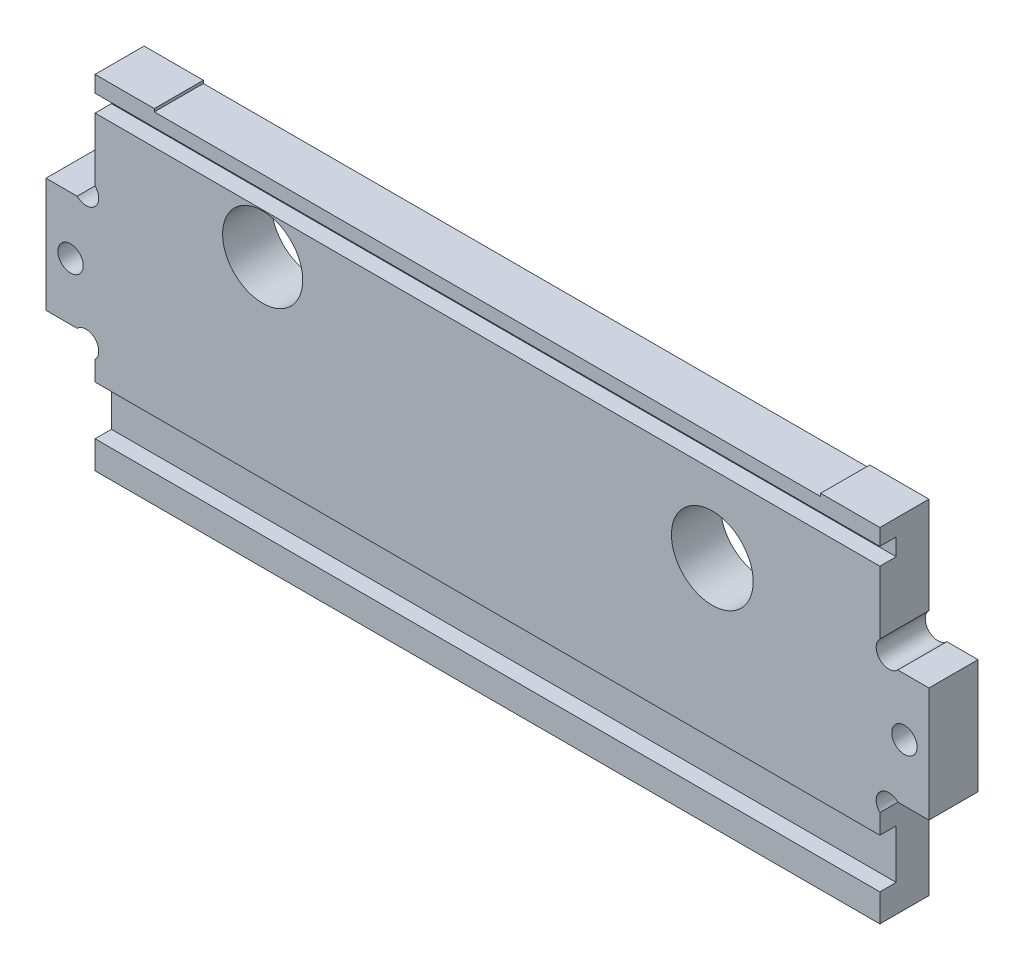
ISO-10303-21;
HEADER;
FILE_DESCRIPTION(('STEP AP214'),'2;1');
FILE_NAME('part.step','',(''),(''),'','','');
FILE_SCHEMA(('AUTOMOTIVE_DESIGN { 1 0 10303 214 1 1 1 1 }'));
ENDSEC;
DATA;
#1=APPLICATION_CONTEXT('core data for automotive mechanical design processes');
#2=APPLICATION_PROTOCOL_DEFINITION('international standard','automotive_design',2000,#1);
#3=PRODUCT_CONTEXT('',#1,'mechanical');
#4=PRODUCT('Part','Part','',(#3));
#5=PRODUCT_RELATED_PRODUCT_CATEGORY('part','',(#4));
#6=PRODUCT_DEFINITION_FORMATION('','',#4);
#7=PRODUCT_DEFINITION_CONTEXT('part definition',#1,'design');
#8=PRODUCT_DEFINITION('design','',#6,#7);
#9=PRODUCT_DEFINITION_SHAPE('','',#8);
#10=(LENGTH_UNIT() NAMED_UNIT(*) SI_UNIT(.MILLI.,.METRE.));
#11=(NAMED_UNIT(*) PLANE_ANGLE_UNIT() SI_UNIT($,.RADIAN.));
#12=(NAMED_UNIT(*) SI_UNIT($,.STERADIAN.) SOLID_ANGLE_UNIT());
#13=UNCERTAINTY_MEASURE_WITH_UNIT(LENGTH_MEASURE(1.E-05),#10,'distance_accuracy_value','');
#14=(GEOMETRIC_REPRESENTATION_CONTEXT(3) GLOBAL_UNCERTAINTY_ASSIGNED_CONTEXT((#13)) GLOBAL_UNIT_ASSIGNED_CONTEXT((#10,
#11,#12)) REPRESENTATION_CONTEXT('',''));
#15=CARTESIAN_POINT('',(0.,0.,0.));
#16=DIRECTION('',(0.,0.,1.));
#17=DIRECTION('',(1.,0.,0.));
#18=AXIS2_PLACEMENT_3D('',#15,#16,#17);
#19=CARTESIAN_POINT('',(4.90398448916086,29.0960155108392,6.));
#20=DIRECTION('',(0.,0.,1.));
#21=DIRECTION('',(1.,0.,0.));
#22=AXIS2_PLACEMENT_3D('',#19,#20,#21);
#23=PLANE('',#22);
#24=DIRECTION('',(-1.,0.,0.));
#25=VECTOR('',#24,1.);
#26=CARTESIAN_POINT('',(4.34837507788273,9.39999999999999,6.));
#27=LINE('',#26,#25);
#28=CARTESIAN_POINT('',(102.,9.39999999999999,6.));
#29=VERTEX_POINT('',#28);
#30=CARTESIAN_POINT('',(6.,9.39999999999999,6.));
#31=VERTEX_POINT('',#30);
#32=EDGE_CURVE('E232',#29,#31,#27,.T.);
#33=ORIENTED_EDGE('',*,*,#32,.F.);
#34=DIRECTION('',(0.,1.,0.));
#35=VECTOR('',#34,1.);
#36=CARTESIAN_POINT('',(102.,11.8079689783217,6.));
#37=LINE('',#36,#35);
#38=CARTESIAN_POINT('',(102.,11.8079689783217,6.));
#39=VERTEX_POINT('',#38);
#40=EDGE_CURVE('E248',#29,#39,#37,.T.);
#41=ORIENTED_EDGE('',*,*,#40,.T.);
#42=CARTESIAN_POINT('',(103.096015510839,12.9039844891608,6.));
#43=DIRECTION('',(0.,0.,-1.));
#44=DIRECTION('',(1.,0.,0.));
#45=AXIS2_PLACEMENT_3D('',#42,#43,#44);
#46=CIRCLE('',#45,1.55);
#47=CARTESIAN_POINT('',(104.192031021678,14.,6.));
#48=VERTEX_POINT('',#47);
#49=EDGE_CURVE('E250',#39,#48,#46,.T.);
#50=ORIENTED_EDGE('',*,*,#49,.T.);
#51=DIRECTION('',(1.,0.,0.));
#52=VECTOR('',#51,1.);
#53=CARTESIAN_POINT('',(108.,14.,6.));
#54=LINE('',#53,#52);
#55=CARTESIAN_POINT('',(108.,14.,6.));
#56=VERTEX_POINT('',#55);
#57=EDGE_CURVE('E252',#48,#56,#54,.T.);
#58=ORIENTED_EDGE('',*,*,#57,.T.);
#59=DIRECTION('',(0.,1.,0.));
#60=VECTOR('',#59,1.);
#61=CARTESIAN_POINT('',(108.,28.,6.));
#62=LINE('',#61,#60);
#63=CARTESIAN_POINT('',(108.,28.,6.));
#64=VERTEX_POINT('',#63);
#65=EDGE_CURVE('E254',#56,#64,#62,.T.);
#66=ORIENTED_EDGE('',*,*,#65,.T.);
#67=DIRECTION('',(-1.,0.,0.));
#68=VECTOR('',#67,1.);
#69=CARTESIAN_POINT('',(104.192031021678,28.,6.));
#70=LINE('',#69,#68);
#71=CARTESIAN_POINT('',(104.192031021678,28.,6.));
#72=VERTEX_POINT('',#71);
#73=EDGE_CURVE('E256',#64,#72,#70,.T.);
#74=ORIENTED_EDGE('',*,*,#73,.T.);
#75=CARTESIAN_POINT('',(103.096015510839,29.0960155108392,6.));
#76=DIRECTION('',(0.,0.,-1.));
#77=DIRECTION('',(-1.,0.,0.));
#78=AXIS2_PLACEMENT_3D('',#75,#76,#77);
#79=CIRCLE('',#78,1.55);
#80=CARTESIAN_POINT('',(102.,30.1920310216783,6.));
#81=VERTEX_POINT('',#80);
#82=EDGE_CURVE('E258',#72,#81,#79,.T.);
#83=ORIENTED_EDGE('',*,*,#82,.T.);
#84=DIRECTION('',(0.,1.,0.));
#85=VECTOR('',#84,1.);
#86=CARTESIAN_POINT('',(102.,42.,6.));
#87=LINE('',#86,#85);
#88=CARTESIAN_POINT('',(102.,37.9,6.));
#89=VERTEX_POINT('',#88);
#90=EDGE_CURVE('E261',#81,#89,#87,.T.);
#91=ORIENTED_EDGE('',*,*,#90,.T.);
#92=DIRECTION('',(1.,0.,0.));
#93=VECTOR('',#92,1.);
#94=CARTESIAN_POINT('',(4.34837507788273,37.9,6.));
#95=LINE('',#94,#93);
#96=CARTESIAN_POINT('',(6.00000000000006,37.9,6.));
#97=VERTEX_POINT('',#96);
#98=EDGE_CURVE('E359',#97,#89,#95,.T.);
#99=ORIENTED_EDGE('',*,*,#98,.F.);
#100=DIRECTION('',(0.,-1.,0.));
#101=VECTOR('',#100,1.);
#102=CARTESIAN_POINT('',(6.00000000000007,42.,6.));
#103=LINE('',#102,#101);
#104=CARTESIAN_POINT('',(6.,30.1920310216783,6.));
#105=VERTEX_POINT('',#104);
#106=EDGE_CURVE('E440',#97,#105,#103,.T.);
#107=ORIENTED_EDGE('',*,*,#106,.T.);
#108=CARTESIAN_POINT('',(4.90398448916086,29.0960155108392,6.));
#109=DIRECTION('',(0.,0.,-1.));
#110=DIRECTION('',(1.,0.,0.));
#111=AXIS2_PLACEMENT_3D('',#108,#109,#110);
#112=CIRCLE('',#111,1.55);
#113=CARTESIAN_POINT('',(3.80796897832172,28.,6.));
#114=VERTEX_POINT('',#113);
#115=EDGE_CURVE('E444',#105,#114,#112,.T.);
#116=ORIENTED_EDGE('',*,*,#115,.T.);
#117=DIRECTION('',(-1.,0.,0.));
#118=VECTOR('',#117,1.);
#119=CARTESIAN_POINT('',(3.80796897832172,28.,6.));
#120=LINE('',#119,#118);
#121=CARTESIAN_POINT('',(0.,28.,6.));
#122=VERTEX_POINT('',#121);
#123=EDGE_CURVE('E446',#114,#122,#120,.T.);
#124=ORIENTED_EDGE('',*,*,#123,.T.);
#125=DIRECTION('',(0.,-1.,0.));
#126=VECTOR('',#125,1.);
#127=CARTESIAN_POINT('',(0.,28.,6.));
#128=LINE('',#127,#126);
#129=CARTESIAN_POINT('',(0.,14.,6.));
#130=VERTEX_POINT('',#129);
#131=EDGE_CURVE('E448',#122,#130,#128,.T.);
#132=ORIENTED_EDGE('',*,*,#131,.T.);
#133=DIRECTION('',(1.,0.,0.));
#134=VECTOR('',#133,1.);
#135=CARTESIAN_POINT('',(0.,14.,6.));
#136=LINE('',#135,#134);
#137=CARTESIAN_POINT('',(3.80796897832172,14.,6.));
#138=VERTEX_POINT('',#137);
#139=EDGE_CURVE('E243',#130,#138,#136,.T.);
#140=ORIENTED_EDGE('',*,*,#139,.T.);
#141=CARTESIAN_POINT('',(4.90398448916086,12.9039844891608,6.));
#142=DIRECTION('',(0.,0.,-1.));
#143=DIRECTION('',(-1.,0.,0.));
#144=AXIS2_PLACEMENT_3D('',#141,#142,#143);
#145=CIRCLE('',#144,1.55);
#146=CARTESIAN_POINT('',(6.,11.8079689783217,6.));
#147=VERTEX_POINT('',#146);
#148=EDGE_CURVE('E239',#138,#147,#145,.T.);
#149=ORIENTED_EDGE('',*,*,#148,.T.);
#150=DIRECTION('',(0.,-1.,0.));
#151=VECTOR('',#150,1.);
#152=CARTESIAN_POINT('',(6.,11.8079689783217,6.));
#153=LINE('',#152,#151);
#154=EDGE_CURVE('E238',#147,#31,#153,.T.);
#155=ORIENTED_EDGE('',*,*,#154,.T.);
#156=EDGE_LOOP('',(#33,#41,#50,#58,#66,#74,#83,#91,#99,#107,#116,#124,#132,#140,#149,#155));
#157=FACE_BOUND('',#156,.T.);
#158=CARTESIAN_POINT('',(26.5,32.9,6.));
#159=DIRECTION('',(0.,0.,1.));
#160=DIRECTION('',(1.,0.,0.));
#161=AXIS2_PLACEMENT_3D('',#158,#159,#160);
#162=CIRCLE('',#161,4.9);
#163=CARTESIAN_POINT('',(31.4,32.9,6.));
#164=VERTEX_POINT('',#163);
#165=EDGE_CURVE('E378',#164,#164,#162,.T.);
#166=ORIENTED_EDGE('',*,*,#165,.F.);
#167=EDGE_LOOP('',(#166));
#168=FACE_BOUND('',#167,.T.);
#169=CARTESIAN_POINT('',(3.,21.,6.));
#170=DIRECTION('',(0.,0.,1.));
#171=DIRECTION('',(1.,0.,0.));
#172=AXIS2_PLACEMENT_3D('',#169,#170,#171);
#173=CIRCLE('',#172,1.55);
#174=CARTESIAN_POINT('',(4.55,21.,6.));
#175=VERTEX_POINT('',#174);
#176=EDGE_CURVE('E390',#175,#175,#173,.T.);
#177=ORIENTED_EDGE('',*,*,#176,.F.);
#178=EDGE_LOOP('',(#177));
#179=FACE_BOUND('',#178,.T.);
#180=CARTESIAN_POINT('',(81.5,28.5,6.));
#181=DIRECTION('',(0.,0.,1.));
#182=DIRECTION('',(1.,0.,0.));
#183=AXIS2_PLACEMENT_3D('',#180,#181,#182);
#184=CIRCLE('',#183,5.);
#185=CARTESIAN_POINT('',(86.5,28.5,6.));
#186=VERTEX_POINT('',#185);
#187=EDGE_CURVE('E396',#186,#186,#184,.T.);
#188=ORIENTED_EDGE('',*,*,#187,.F.);
#189=EDGE_LOOP('',(#188));
#190=FACE_BOUND('',#189,.T.);
#191=CARTESIAN_POINT('',(105.,21.,6.));
#192=DIRECTION('',(0.,0.,1.));
#193=DIRECTION('',(-1.,0.,0.));
#194=AXIS2_PLACEMENT_3D('',#191,#192,#193);
#195=CIRCLE('',#194,1.55000000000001);
#196=CARTESIAN_POINT('',(103.45,21.,6.));
#197=VERTEX_POINT('',#196);
#198=EDGE_CURVE('E384',#197,#197,#195,.T.);
#199=ORIENTED_EDGE('',*,*,#198,.F.);
#200=EDGE_LOOP('',(#199));
#201=FACE_BOUND('',#200,.T.);
#202=ADVANCED_FACE('F30',(#157,#168,#179,#190,#201),#23,.T.);
#203=DIRECTION('',(-1.,0.,0.));
#204=VECTOR('',#203,1.);
#205=CARTESIAN_POINT('',(4.34837507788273,40.,6.));
#206=LINE('',#205,#204);
#207=CARTESIAN_POINT('',(102.,40.,6.));
#208=VERTEX_POINT('',#207);
#209=CARTESIAN_POINT('',(6.00000000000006,40.,6.));
#210=VERTEX_POINT('',#209);
#211=EDGE_CURVE('E361',#208,#210,#206,.T.);
#212=ORIENTED_EDGE('',*,*,#211,.F.);
#213=CARTESIAN_POINT('',(102.,42.,6.));
#214=VERTEX_POINT('',#213);
#215=EDGE_CURVE('E260',#208,#214,#87,.T.);
#216=ORIENTED_EDGE('',*,*,#215,.T.);
#217=DIRECTION('',(-1.,0.,0.));
#218=VECTOR('',#217,1.);
#219=CARTESIAN_POINT('',(94.75,42.,6.));
#220=LINE('',#219,#218);
#221=CARTESIAN_POINT('',(94.75,42.,6.));
#222=VERTEX_POINT('',#221);
#223=EDGE_CURVE('E264',#214,#222,#220,.T.);
#224=ORIENTED_EDGE('',*,*,#223,.T.);
#225=DIRECTION('',(0.,-1.,0.));
#226=VECTOR('',#225,1.);
#227=CARTESIAN_POINT('',(94.75,42.,6.));
#228=LINE('',#227,#226);
#229=CARTESIAN_POINT('',(94.75,41.65,6.));
#230=VERTEX_POINT('',#229);
#231=EDGE_CURVE('E266',#222,#230,#228,.T.);
#232=ORIENTED_EDGE('',*,*,#231,.T.);
#233=DIRECTION('',(-1.,0.,0.));
#234=VECTOR('',#233,1.);
#235=CARTESIAN_POINT('',(13.25,41.65,6.));
#236=LINE('',#235,#234);
#237=CARTESIAN_POINT('',(13.25,41.65,6.));
#238=VERTEX_POINT('',#237);
#239=EDGE_CURVE('E268',#230,#238,#236,.T.);
#240=ORIENTED_EDGE('',*,*,#239,.T.);
#241=DIRECTION('',(0.,1.,0.));
#242=VECTOR('',#241,1.);
#243=CARTESIAN_POINT('',(13.25,42.,6.));
#244=LINE('',#243,#242);
#245=CARTESIAN_POINT('',(13.25,42.,6.));
#246=VERTEX_POINT('',#245);
#247=EDGE_CURVE('E270',#238,#246,#244,.T.);
#248=ORIENTED_EDGE('',*,*,#247,.T.);
#249=DIRECTION('',(-1.,0.,0.));
#250=VECTOR('',#249,1.);
#251=CARTESIAN_POINT('',(6.00000000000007,42.,6.));
#252=LINE('',#251,#250);
#253=CARTESIAN_POINT('',(6.00000000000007,42.,6.));
#254=VERTEX_POINT('',#253);
#255=EDGE_CURVE('E272',#246,#254,#252,.T.);
#256=ORIENTED_EDGE('',*,*,#255,.T.);
#257=EDGE_CURVE('E441',#254,#210,#103,.T.);
#258=ORIENTED_EDGE('',*,*,#257,.T.);
#259=EDGE_LOOP('',(#212,#216,#224,#232,#240,#248,#256,#258));
#260=FACE_BOUND('',#259,.T.);
#261=ADVANCED_FACE('F535',(#260),#23,.T.);
#262=DIRECTION('',(1.,0.,0.));
#263=VECTOR('',#262,1.);
#264=CARTESIAN_POINT('',(4.34837507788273,3.40000000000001,6.));
#265=LINE('',#264,#263);
#266=CARTESIAN_POINT('',(6.,3.40000000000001,6.));
#267=VERTEX_POINT('',#266);
#268=CARTESIAN_POINT('',(102.,3.40000000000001,6.));
#269=VERTEX_POINT('',#268);
#270=EDGE_CURVE('E217',#267,#269,#265,.T.);
#271=ORIENTED_EDGE('',*,*,#270,.F.);
#272=CARTESIAN_POINT('',(6.,0.,6.));
#273=VERTEX_POINT('',#272);
#274=EDGE_CURVE('E228',#267,#273,#153,.T.);
#275=ORIENTED_EDGE('',*,*,#274,.T.);
#276=DIRECTION('',(1.,0.,0.));
#277=VECTOR('',#276,1.);
#278=CARTESIAN_POINT('',(6.,0.,6.));
#279=LINE('',#278,#277);
#280=CARTESIAN_POINT('',(102.,0.,6.));
#281=VERTEX_POINT('',#280);
#282=EDGE_CURVE('E242',#273,#281,#279,.T.);
#283=ORIENTED_EDGE('',*,*,#282,.T.);
#284=EDGE_CURVE('E231',#281,#269,#37,.T.);
#285=ORIENTED_EDGE('',*,*,#284,.T.);
#286=EDGE_LOOP('',(#271,#275,#283,#285));
#287=FACE_BOUND('',#286,.T.);
#288=ADVANCED_FACE('F227',(#287),#23,.T.);
#289=CARTESIAN_POINT('',(4.90398448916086,29.0960155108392,0.));
#290=DIRECTION('',(0.,0.,1.));
#291=DIRECTION('',(1.,0.,0.));
#292=AXIS2_PLACEMENT_3D('',#289,#290,#291);
#293=PLANE('',#292);
#294=CARTESIAN_POINT('',(105.,21.,0.));
#295=DIRECTION('',(0.,0.,1.));
#296=DIRECTION('',(-1.,0.,0.));
#297=AXIS2_PLACEMENT_3D('',#294,#295,#296);
#298=CIRCLE('',#297,1.55000000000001);
#299=CARTESIAN_POINT('',(103.45,21.,0.));
#300=VERTEX_POINT('',#299);
#301=EDGE_CURVE('E381',#300,#300,#298,.T.);
#302=ORIENTED_EDGE('',*,*,#301,.T.);
#303=EDGE_LOOP('',(#302));
#304=FACE_BOUND('',#303,.T.);
#305=CARTESIAN_POINT('',(81.5,28.5,0.));
#306=DIRECTION('',(0.,0.,1.));
#307=DIRECTION('',(1.,0.,0.));
#308=AXIS2_PLACEMENT_3D('',#305,#306,#307);
#309=CIRCLE('',#308,5.);
#310=CARTESIAN_POINT('',(86.5,28.5,0.));
#311=VERTEX_POINT('',#310);
#312=EDGE_CURVE('E393',#311,#311,#309,.T.);
#313=ORIENTED_EDGE('',*,*,#312,.T.);
#314=EDGE_LOOP('',(#313));
#315=FACE_BOUND('',#314,.T.);
#316=DIRECTION('',(0.,-1.,0.));
#317=VECTOR('',#316,1.);
#318=CARTESIAN_POINT('',(6.00000000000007,42.,0.));
#319=LINE('',#318,#317);
#320=CARTESIAN_POINT('',(6.00000000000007,42.,0.));
#321=VERTEX_POINT('',#320);
#322=CARTESIAN_POINT('',(6.,30.1920310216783,0.));
#323=VERTEX_POINT('',#322);
#324=EDGE_CURVE('E399',#321,#323,#319,.T.);
#325=ORIENTED_EDGE('',*,*,#324,.F.);
#326=DIRECTION('',(-1.,0.,0.));
#327=VECTOR('',#326,1.);
#328=CARTESIAN_POINT('',(6.00000000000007,42.,0.));
#329=LINE('',#328,#327);
#330=CARTESIAN_POINT('',(13.25,42.,0.));
#331=VERTEX_POINT('',#330);
#332=EDGE_CURVE('E438',#331,#321,#329,.T.);
#333=ORIENTED_EDGE('',*,*,#332,.F.);
#334=DIRECTION('',(0.,1.,0.));
#335=VECTOR('',#334,1.);
#336=CARTESIAN_POINT('',(13.25,42.,0.));
#337=LINE('',#336,#335);
#338=CARTESIAN_POINT('',(13.25,41.65,0.));
#339=VERTEX_POINT('',#338);
#340=EDGE_CURVE('E436',#339,#331,#337,.T.);
#341=ORIENTED_EDGE('',*,*,#340,.F.);
#342=DIRECTION('',(-1.,0.,0.));
#343=VECTOR('',#342,1.);
#344=CARTESIAN_POINT('',(13.25,41.65,0.));
#345=LINE('',#344,#343);
#346=CARTESIAN_POINT('',(94.75,41.65,0.));
#347=VERTEX_POINT('',#346);
#348=EDGE_CURVE('E434',#347,#339,#345,.T.);
#349=ORIENTED_EDGE('',*,*,#348,.F.);
#350=DIRECTION('',(0.,-1.,0.));
#351=VECTOR('',#350,1.);
#352=CARTESIAN_POINT('',(94.75,42.,0.));
#353=LINE('',#352,#351);
#354=CARTESIAN_POINT('',(94.75,42.,0.));
#355=VERTEX_POINT('',#354);
#356=EDGE_CURVE('E432',#355,#347,#353,.T.);
#357=ORIENTED_EDGE('',*,*,#356,.F.);
#358=DIRECTION('',(-1.,0.,0.));
#359=VECTOR('',#358,1.);
#360=CARTESIAN_POINT('',(94.75,42.,0.));
#361=LINE('',#360,#359);
#362=CARTESIAN_POINT('',(102.,42.,0.));
#363=VERTEX_POINT('',#362);
#364=EDGE_CURVE('E430',#363,#355,#361,.T.);
#365=ORIENTED_EDGE('',*,*,#364,.F.);
#366=DIRECTION('',(0.,1.,0.));
#367=VECTOR('',#366,1.);
#368=CARTESIAN_POINT('',(102.,42.,0.));
#369=LINE('',#368,#367);
#370=CARTESIAN_POINT('',(102.,30.1920310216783,0.));
#371=VERTEX_POINT('',#370);
#372=EDGE_CURVE('E428',#371,#363,#369,.T.);
#373=ORIENTED_EDGE('',*,*,#372,.F.);
#374=CARTESIAN_POINT('',(103.096015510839,29.0960155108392,0.));
#375=DIRECTION('',(0.,0.,-1.));
#376=DIRECTION('',(-1.,0.,0.));
#377=AXIS2_PLACEMENT_3D('',#374,#375,#376);
#378=CIRCLE('',#377,1.55);
#379=CARTESIAN_POINT('',(104.192031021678,28.,0.));
#380=VERTEX_POINT('',#379);
#381=EDGE_CURVE('E426',#380,#371,#378,.T.);
#382=ORIENTED_EDGE('',*,*,#381,.F.);
#383=DIRECTION('',(-1.,0.,0.));
#384=VECTOR('',#383,1.);
#385=CARTESIAN_POINT('',(104.192031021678,28.,0.));
#386=LINE('',#385,#384);
#387=CARTESIAN_POINT('',(108.,28.,0.));
#388=VERTEX_POINT('',#387);
#389=EDGE_CURVE('E424',#388,#380,#386,.T.);
#390=ORIENTED_EDGE('',*,*,#389,.F.);
#391=DIRECTION('',(0.,1.,0.));
#392=VECTOR('',#391,1.);
#393=CARTESIAN_POINT('',(108.,28.,0.));
#394=LINE('',#393,#392);
#395=CARTESIAN_POINT('',(108.,14.,0.));
#396=VERTEX_POINT('',#395);
#397=EDGE_CURVE('E422',#396,#388,#394,.T.);
#398=ORIENTED_EDGE('',*,*,#397,.F.);
#399=DIRECTION('',(1.,0.,0.));
#400=VECTOR('',#399,1.);
#401=CARTESIAN_POINT('',(108.,14.,0.));
#402=LINE('',#401,#400);
#403=CARTESIAN_POINT('',(104.192031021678,14.,0.));
#404=VERTEX_POINT('',#403);
#405=EDGE_CURVE('E420',#404,#396,#402,.T.);
#406=ORIENTED_EDGE('',*,*,#405,.F.);
#407=CARTESIAN_POINT('',(103.096015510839,12.9039844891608,0.));
#408=DIRECTION('',(0.,0.,-1.));
#409=DIRECTION('',(1.,0.,0.));
#410=AXIS2_PLACEMENT_3D('',#407,#408,#409);
#411=CIRCLE('',#410,1.55);
#412=CARTESIAN_POINT('',(102.,11.8079689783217,0.));
#413=VERTEX_POINT('',#412);
#414=EDGE_CURVE('E418',#413,#404,#411,.T.);
#415=ORIENTED_EDGE('',*,*,#414,.F.);
#416=DIRECTION('',(0.,1.,0.));
#417=VECTOR('',#416,1.);
#418=CARTESIAN_POINT('',(102.,11.8079689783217,0.));
#419=LINE('',#418,#417);
#420=CARTESIAN_POINT('',(102.,0.,0.));
#421=VERTEX_POINT('',#420);
#422=EDGE_CURVE('E416',#421,#413,#419,.T.);
#423=ORIENTED_EDGE('',*,*,#422,.F.);
#424=DIRECTION('',(1.,0.,0.));
#425=VECTOR('',#424,1.);
#426=CARTESIAN_POINT('',(6.,0.,0.));
#427=LINE('',#426,#425);
#428=CARTESIAN_POINT('',(6.,0.,0.));
#429=VERTEX_POINT('',#428);
#430=EDGE_CURVE('E414',#429,#421,#427,.T.);
#431=ORIENTED_EDGE('',*,*,#430,.F.);
#432=DIRECTION('',(0.,-1.,0.));
#433=VECTOR('',#432,1.);
#434=CARTESIAN_POINT('',(6.,11.8079689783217,0.));
#435=LINE('',#434,#433);
#436=CARTESIAN_POINT('',(6.,11.8079689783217,0.));
#437=VERTEX_POINT('',#436);
#438=EDGE_CURVE('E412',#437,#429,#435,.T.);
#439=ORIENTED_EDGE('',*,*,#438,.F.);
#440=CARTESIAN_POINT('',(4.90398448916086,12.9039844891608,0.));
#441=DIRECTION('',(0.,0.,-1.));
#442=DIRECTION('',(-1.,0.,0.));
#443=AXIS2_PLACEMENT_3D('',#440,#441,#442);
#444=CIRCLE('',#443,1.55);
#445=CARTESIAN_POINT('',(3.80796897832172,14.,0.));
#446=VERTEX_POINT('',#445);
#447=EDGE_CURVE('E410',#446,#437,#444,.T.);
#448=ORIENTED_EDGE('',*,*,#447,.F.);
#449=DIRECTION('',(1.,0.,0.));
#450=VECTOR('',#449,1.);
#451=CARTESIAN_POINT('',(0.,14.,0.));
#452=LINE('',#451,#450);
#453=CARTESIAN_POINT('',(0.,14.,0.));
#454=VERTEX_POINT('',#453);
#455=EDGE_CURVE('E408',#454,#446,#452,.T.);
#456=ORIENTED_EDGE('',*,*,#455,.F.);
#457=DIRECTION('',(0.,-1.,0.));
#458=VECTOR('',#457,1.);
#459=CARTESIAN_POINT('',(0.,28.,0.));
#460=LINE('',#459,#458);
#461=CARTESIAN_POINT('',(0.,28.,0.));
#462=VERTEX_POINT('',#461);
#463=EDGE_CURVE('E406',#462,#454,#460,.T.);
#464=ORIENTED_EDGE('',*,*,#463,.F.);
#465=DIRECTION('',(-1.,0.,0.));
#466=VECTOR('',#465,1.);
#467=CARTESIAN_POINT('',(3.80796897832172,28.,0.));
#468=LINE('',#467,#466);
#469=CARTESIAN_POINT('',(3.80796897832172,28.,0.));
#470=VERTEX_POINT('',#469);
#471=EDGE_CURVE('E404',#470,#462,#468,.T.);
#472=ORIENTED_EDGE('',*,*,#471,.F.);
#473=CARTESIAN_POINT('',(4.90398448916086,29.0960155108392,0.));
#474=DIRECTION('',(0.,0.,-1.));
#475=DIRECTION('',(1.,0.,0.));
#476=AXIS2_PLACEMENT_3D('',#473,#474,#475);
#477=CIRCLE('',#476,1.55);
#478=EDGE_CURVE('E402',#323,#470,#477,.T.);
#479=ORIENTED_EDGE('',*,*,#478,.F.);
#480=EDGE_LOOP('',(#325,#333,#341,#349,#357,#365,#373,#382,#390,#398,#406,#415,#423,#431,#439,
#448,#456,#464,#472,#479));
#481=FACE_BOUND('',#480,.T.);
#482=CARTESIAN_POINT('',(3.,21.,0.));
#483=DIRECTION('',(0.,0.,1.));
#484=DIRECTION('',(1.,0.,0.));
#485=AXIS2_PLACEMENT_3D('',#482,#483,#484);
#486=CIRCLE('',#485,1.55);
#487=CARTESIAN_POINT('',(4.55,21.,0.));
#488=VERTEX_POINT('',#487);
#489=EDGE_CURVE('E387',#488,#488,#486,.T.);
#490=ORIENTED_EDGE('',*,*,#489,.T.);
#491=EDGE_LOOP('',(#490));
#492=FACE_BOUND('',#491,.T.);
#493=CARTESIAN_POINT('',(26.5,32.9,0.));
#494=DIRECTION('',(0.,0.,1.));
#495=DIRECTION('',(1.,0.,0.));
#496=AXIS2_PLACEMENT_3D('',#493,#494,#495);
#497=CIRCLE('',#496,4.9);
#498=CARTESIAN_POINT('',(31.4,32.9,0.));
#499=VERTEX_POINT('',#498);
#500=EDGE_CURVE('E375',#499,#499,#497,.T.);
#501=ORIENTED_EDGE('',*,*,#500,.T.);
#502=EDGE_LOOP('',(#501));
#503=FACE_BOUND('',#502,.T.);
#504=ADVANCED_FACE('F519',(#304,#315,#481,#492,#503),#293,.F.);
#505=CARTESIAN_POINT('',(6.00000000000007,42.,6.));
#506=DIRECTION('',(1.,0.,0.));
#507=DIRECTION('',(0.,1.,0.));
#508=AXIS2_PLACEMENT_3D('',#505,#506,#507);
#509=PLANE('',#508);
#510=DIRECTION('',(0.,-1.,0.));
#511=VECTOR('',#510,1.);
#512=CARTESIAN_POINT('',(6.00000000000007,42.,4.));
#513=LINE('',#512,#511);
#514=CARTESIAN_POINT('',(6.00000000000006,40.,4.));
#515=VERTEX_POINT('',#514);
#516=CARTESIAN_POINT('',(6.00000000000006,37.9,4.));
#517=VERTEX_POINT('',#516);
#518=EDGE_CURVE('E367',#515,#517,#513,.T.);
#519=ORIENTED_EDGE('',*,*,#518,.F.);
#520=DIRECTION('',(0.,0.,1.));
#521=VECTOR('',#520,1.);
#522=CARTESIAN_POINT('',(6.00000000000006,40.,6.));
#523=LINE('',#522,#521);
#524=EDGE_CURVE('E372',#515,#210,#523,.T.);
#525=ORIENTED_EDGE('',*,*,#524,.T.);
#526=ORIENTED_EDGE('',*,*,#257,.F.);
#527=DIRECTION('',(0.,0.,-1.));
#528=VECTOR('',#527,1.);
#529=CARTESIAN_POINT('',(6.00000000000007,42.,6.));
#530=LINE('',#529,#528);
#531=EDGE_CURVE('E274',#254,#321,#530,.T.);
#532=ORIENTED_EDGE('',*,*,#531,.T.);
#533=ORIENTED_EDGE('',*,*,#324,.T.);
#534=DIRECTION('',(0.,0.,-1.));
#535=VECTOR('',#534,1.);
#536=CARTESIAN_POINT('',(6.,30.1920310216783,6.));
#537=LINE('',#536,#535);
#538=EDGE_CURVE('E329',#105,#323,#537,.T.);
#539=ORIENTED_EDGE('',*,*,#538,.F.);
#540=ORIENTED_EDGE('',*,*,#106,.F.);
#541=DIRECTION('',(0.,0.,-1.));
#542=VECTOR('',#541,1.);
#543=CARTESIAN_POINT('',(6.00000000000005,37.9,6.));
#544=LINE('',#543,#542);
#545=EDGE_CURVE('E369',#97,#517,#544,.T.);
#546=ORIENTED_EDGE('',*,*,#545,.T.);
#547=EDGE_LOOP('',(#519,#525,#526,#532,#533,#539,#540,#546));
#548=FACE_BOUND('',#547,.T.);
#549=ADVANCED_FACE('F32',(#548),#509,.F.);
#550=CARTESIAN_POINT('',(4.90398448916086,29.0960155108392,6.));
#551=DIRECTION('',(0.,0.,-1.));
#552=DIRECTION('',(-1.,0.,0.));
#553=AXIS2_PLACEMENT_3D('',#550,#551,#552);
#554=CYLINDRICAL_SURFACE('',#553,1.55);
#555=ORIENTED_EDGE('',*,*,#478,.T.);
#556=DIRECTION('',(0.,0.,-1.));
#557=VECTOR('',#556,1.);
#558=CARTESIAN_POINT('',(3.80796897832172,28.,6.));
#559=LINE('',#558,#557);
#560=EDGE_CURVE('E326',#114,#470,#559,.T.);
#561=ORIENTED_EDGE('',*,*,#560,.F.);
#562=ORIENTED_EDGE('',*,*,#115,.F.);
#563=ORIENTED_EDGE('',*,*,#538,.T.);
#564=EDGE_LOOP('',(#555,#561,#562,#563));
#565=FACE_BOUND('',#564,.T.);
#566=ADVANCED_FACE('F508',(#565),#554,.F.);
#567=CARTESIAN_POINT('',(3.80796897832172,28.,6.));
#568=DIRECTION('',(0.,-1.,0.));
#569=DIRECTION('',(0.,0.,-1.));
#570=AXIS2_PLACEMENT_3D('',#567,#568,#569);
#571=PLANE('',#570);
#572=ORIENTED_EDGE('',*,*,#471,.T.);
#573=DIRECTION('',(0.,0.,-1.));
#574=VECTOR('',#573,1.);
#575=CARTESIAN_POINT('',(0.,28.,6.));
#576=LINE('',#575,#574);
#577=EDGE_CURVE('E323',#122,#462,#576,.T.);
#578=ORIENTED_EDGE('',*,*,#577,.F.);
#579=ORIENTED_EDGE('',*,*,#123,.F.);
#580=ORIENTED_EDGE('',*,*,#560,.T.);
#581=EDGE_LOOP('',(#572,#578,#579,#580));
#582=FACE_BOUND('',#581,.T.);
#583=ADVANCED_FACE('F513',(#582),#571,.F.);
#584=CARTESIAN_POINT('',(0.,28.,6.));
#585=DIRECTION('',(1.,0.,0.));
#586=DIRECTION('',(0.,0.,-1.));
#587=AXIS2_PLACEMENT_3D('',#584,#585,#586);
#588=PLANE('',#587);
#589=ORIENTED_EDGE('',*,*,#463,.T.);
#590=DIRECTION('',(0.,0.,-1.));
#591=VECTOR('',#590,1.);
#592=CARTESIAN_POINT('',(0.,14.,6.));
#593=LINE('',#592,#591);
#594=EDGE_CURVE('E320',#130,#454,#593,.T.);
#595=ORIENTED_EDGE('',*,*,#594,.F.);
#596=ORIENTED_EDGE('',*,*,#131,.F.);
#597=ORIENTED_EDGE('',*,*,#577,.T.);
#598=EDGE_LOOP('',(#589,#595,#596,#597));
#599=FACE_BOUND('',#598,.T.);
#600=ADVANCED_FACE('F517',(#599),#588,.F.);
#601=CARTESIAN_POINT('',(0.,14.,6.));
#602=DIRECTION('',(0.,1.,0.));
#603=DIRECTION('',(0.,0.,1.));
#604=AXIS2_PLACEMENT_3D('',#601,#602,#603);
#605=PLANE('',#604);
#606=ORIENTED_EDGE('',*,*,#455,.T.);
#607=DIRECTION('',(0.,0.,-1.));
#608=VECTOR('',#607,1.);
#609=CARTESIAN_POINT('',(3.80796897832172,14.,6.));
#610=LINE('',#609,#608);
#611=EDGE_CURVE('E317',#138,#446,#610,.T.);
#612=ORIENTED_EDGE('',*,*,#611,.F.);
#613=ORIENTED_EDGE('',*,*,#139,.F.);
#614=ORIENTED_EDGE('',*,*,#594,.T.);
#615=EDGE_LOOP('',(#606,#612,#613,#614));
#616=FACE_BOUND('',#615,.T.);
#617=ADVANCED_FACE('F458',(#616),#605,.F.);
#618=CARTESIAN_POINT('',(4.90398448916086,12.9039844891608,6.));
#619=DIRECTION('',(0.,0.,-1.));
#620=DIRECTION('',(-1.,0.,0.));
#621=AXIS2_PLACEMENT_3D('',#618,#619,#620);
#622=CYLINDRICAL_SURFACE('',#621,1.55);
#623=ORIENTED_EDGE('',*,*,#447,.T.);
#624=DIRECTION('',(0.,0.,-1.));
#625=VECTOR('',#624,1.);
#626=CARTESIAN_POINT('',(6.,11.8079689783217,6.));
#627=LINE('',#626,#625);
#628=EDGE_CURVE('E314',#147,#437,#627,.T.);
#629=ORIENTED_EDGE('',*,*,#628,.F.);
#630=ORIENTED_EDGE('',*,*,#148,.F.);
#631=ORIENTED_EDGE('',*,*,#611,.T.);
#632=EDGE_LOOP('',(#623,#629,#630,#631));
#633=FACE_BOUND('',#632,.T.);
#634=ADVANCED_FACE('F462',(#633),#622,.F.);
#635=CARTESIAN_POINT('',(6.,11.8079689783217,6.));
#636=DIRECTION('',(1.,0.,0.));
#637=DIRECTION('',(0.,1.,0.));
#638=AXIS2_PLACEMENT_3D('',#635,#636,#637);
#639=PLANE('',#638);
#640=DIRECTION('',(0.,-1.,0.));
#641=VECTOR('',#640,1.);
#642=CARTESIAN_POINT('',(6.,11.8079689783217,4.));
#643=LINE('',#642,#641);
#644=CARTESIAN_POINT('',(6.,9.39999999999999,4.));
#645=VERTEX_POINT('',#644);
#646=CARTESIAN_POINT('',(6.,3.40000000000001,4.));
#647=VERTEX_POINT('',#646);
#648=EDGE_CURVE('E223',#645,#647,#643,.T.);
#649=ORIENTED_EDGE('',*,*,#648,.F.);
#650=DIRECTION('',(0.,0.,1.));
#651=VECTOR('',#650,1.);
#652=CARTESIAN_POINT('',(6.,9.39999999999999,6.));
#653=LINE('',#652,#651);
#654=EDGE_CURVE('E222',#645,#31,#653,.T.);
#655=ORIENTED_EDGE('',*,*,#654,.T.);
#656=ORIENTED_EDGE('',*,*,#154,.F.);
#657=ORIENTED_EDGE('',*,*,#628,.T.);
#658=ORIENTED_EDGE('',*,*,#438,.T.);
#659=DIRECTION('',(0.,0.,-1.));
#660=VECTOR('',#659,1.);
#661=CARTESIAN_POINT('',(6.,0.,6.));
#662=LINE('',#661,#660);
#663=EDGE_CURVE('E236',#273,#429,#662,.T.);
#664=ORIENTED_EDGE('',*,*,#663,.F.);
#665=ORIENTED_EDGE('',*,*,#274,.F.);
#666=DIRECTION('',(0.,0.,-1.));
#667=VECTOR('',#666,1.);
#668=CARTESIAN_POINT('',(6.,3.40000000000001,6.));
#669=LINE('',#668,#667);
#670=EDGE_CURVE('E214',#267,#647,#669,.T.);
#671=ORIENTED_EDGE('',*,*,#670,.T.);
#672=EDGE_LOOP('',(#649,#655,#656,#657,#658,#664,#665,#671));
#673=FACE_BOUND('',#672,.T.);
#674=ADVANCED_FACE('F234',(#673),#639,.F.);
#675=CARTESIAN_POINT('',(6.,0.,6.));
#676=DIRECTION('',(0.,1.,0.));
#677=DIRECTION('',(-1.,0.,0.));
#678=AXIS2_PLACEMENT_3D('',#675,#676,#677);
#679=PLANE('',#678);
#680=ORIENTED_EDGE('',*,*,#430,.T.);
#681=DIRECTION('',(0.,0.,-1.));
#682=VECTOR('',#681,1.);
#683=CARTESIAN_POINT('',(102.,0.,6.));
#684=LINE('',#683,#682);
#685=EDGE_CURVE('E310',#281,#421,#684,.T.);
#686=ORIENTED_EDGE('',*,*,#685,.F.);
#687=ORIENTED_EDGE('',*,*,#282,.F.);
#688=ORIENTED_EDGE('',*,*,#663,.T.);
#689=EDGE_LOOP('',(#680,#686,#687,#688));
#690=FACE_BOUND('',#689,.T.);
#691=ADVANCED_FACE('F523',(#690),#679,.F.);
#692=CARTESIAN_POINT('',(102.,11.8079689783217,6.));
#693=DIRECTION('',(-1.,0.,0.));
#694=DIRECTION('',(0.,-1.,0.));
#695=AXIS2_PLACEMENT_3D('',#692,#693,#694);
#696=PLANE('',#695);
#697=ORIENTED_EDGE('',*,*,#40,.F.);
#698=DIRECTION('',(0.,0.,-1.));
#699=VECTOR('',#698,1.);
#700=CARTESIAN_POINT('',(102.,9.39999999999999,6.));
#701=LINE('',#700,#699);
#702=CARTESIAN_POINT('',(102.,9.39999999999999,4.));
#703=VERTEX_POINT('',#702);
#704=EDGE_CURVE('E11',#29,#703,#701,.T.);
#705=ORIENTED_EDGE('',*,*,#704,.T.);
#706=DIRECTION('',(0.,1.,0.));
#707=VECTOR('',#706,1.);
#708=CARTESIAN_POINT('',(102.,11.8079689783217,4.));
#709=LINE('',#708,#707);
#710=CARTESIAN_POINT('',(102.,3.40000000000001,4.));
#711=VERTEX_POINT('',#710);
#712=EDGE_CURVE('E340',#711,#703,#709,.T.);
#713=ORIENTED_EDGE('',*,*,#712,.F.);
#714=DIRECTION('',(0.,0.,1.));
#715=VECTOR('',#714,1.);
#716=CARTESIAN_POINT('',(102.,3.40000000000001,6.));
#717=LINE('',#716,#715);
#718=EDGE_CURVE('E38',#711,#269,#717,.T.);
#719=ORIENTED_EDGE('',*,*,#718,.T.);
#720=ORIENTED_EDGE('',*,*,#284,.F.);
#721=ORIENTED_EDGE('',*,*,#685,.T.);
#722=ORIENTED_EDGE('',*,*,#422,.T.);
#723=DIRECTION('',(0.,0.,-1.));
#724=VECTOR('',#723,1.);
#725=CARTESIAN_POINT('',(102.,11.8079689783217,6.));
#726=LINE('',#725,#724);
#727=EDGE_CURVE('E307',#39,#413,#726,.T.);
#728=ORIENTED_EDGE('',*,*,#727,.F.);
#729=EDGE_LOOP('',(#697,#705,#713,#719,#720,#721,#722,#728));
#730=FACE_BOUND('',#729,.T.);
#731=ADVANCED_FACE('F344',(#730),#696,.F.);
#732=CARTESIAN_POINT('',(103.096015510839,12.9039844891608,6.));
#733=DIRECTION('',(0.,0.,-1.));
#734=DIRECTION('',(-1.,0.,0.));
#735=AXIS2_PLACEMENT_3D('',#732,#733,#734);
#736=CYLINDRICAL_SURFACE('',#735,1.55);
#737=ORIENTED_EDGE('',*,*,#414,.T.);
#738=DIRECTION('',(0.,0.,-1.));
#739=VECTOR('',#738,1.);
#740=CARTESIAN_POINT('',(104.192031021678,14.,6.));
#741=LINE('',#740,#739);
#742=EDGE_CURVE('E304',#48,#404,#741,.T.);
#743=ORIENTED_EDGE('',*,*,#742,.F.);
#744=ORIENTED_EDGE('',*,*,#49,.F.);
#745=ORIENTED_EDGE('',*,*,#727,.T.);
#746=EDGE_LOOP('',(#737,#743,#744,#745));
#747=FACE_BOUND('',#746,.T.);
#748=ADVANCED_FACE('F471',(#747),#736,.F.);
#749=CARTESIAN_POINT('',(108.,14.,6.));
#750=DIRECTION('',(0.,1.,0.));
#751=DIRECTION('',(0.,0.,1.));
#752=AXIS2_PLACEMENT_3D('',#749,#750,#751);
#753=PLANE('',#752);
#754=ORIENTED_EDGE('',*,*,#405,.T.);
#755=DIRECTION('',(0.,0.,-1.));
#756=VECTOR('',#755,1.);
#757=CARTESIAN_POINT('',(108.,14.,6.));
#758=LINE('',#757,#756);
#759=EDGE_CURVE('E301',#56,#396,#758,.T.);
#760=ORIENTED_EDGE('',*,*,#759,.F.);
#761=ORIENTED_EDGE('',*,*,#57,.F.);
#762=ORIENTED_EDGE('',*,*,#742,.T.);
#763=EDGE_LOOP('',(#754,#760,#761,#762));
#764=FACE_BOUND('',#763,.T.);
#765=ADVANCED_FACE('F477',(#764),#753,.F.);
#766=CARTESIAN_POINT('',(108.,28.,6.));
#767=DIRECTION('',(-1.,0.,0.));
#768=DIRECTION('',(0.,0.,1.));
#769=AXIS2_PLACEMENT_3D('',#766,#767,#768);
#770=PLANE('',#769);
#771=ORIENTED_EDGE('',*,*,#397,.T.);
#772=DIRECTION('',(0.,0.,-1.));
#773=VECTOR('',#772,1.);
#774=CARTESIAN_POINT('',(108.,28.,6.));
#775=LINE('',#774,#773);
#776=EDGE_CURVE('E298',#64,#388,#775,.T.);
#777=ORIENTED_EDGE('',*,*,#776,.F.);
#778=ORIENTED_EDGE('',*,*,#65,.F.);
#779=ORIENTED_EDGE('',*,*,#759,.T.);
#780=EDGE_LOOP('',(#771,#777,#778,#779));
#781=FACE_BOUND('',#780,.T.);
#782=ADVANCED_FACE('F481',(#781),#770,.F.);
#783=CARTESIAN_POINT('',(104.192031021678,28.,6.));
#784=DIRECTION('',(0.,-1.,0.));
#785=DIRECTION('',(0.,0.,-1.));
#786=AXIS2_PLACEMENT_3D('',#783,#784,#785);
#787=PLANE('',#786);
#788=ORIENTED_EDGE('',*,*,#389,.T.);
#789=DIRECTION('',(0.,0.,-1.));
#790=VECTOR('',#789,1.);
#791=CARTESIAN_POINT('',(104.192031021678,28.,6.));
#792=LINE('',#791,#790);
#793=EDGE_CURVE('E295',#72,#380,#792,.T.);
#794=ORIENTED_EDGE('',*,*,#793,.F.);
#795=ORIENTED_EDGE('',*,*,#73,.F.);
#796=ORIENTED_EDGE('',*,*,#776,.T.);
#797=EDGE_LOOP('',(#788,#794,#795,#796));
#798=FACE_BOUND('',#797,.T.);
#799=ADVANCED_FACE('F486',(#798),#787,.F.);
#800=CARTESIAN_POINT('',(103.096015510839,29.0960155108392,6.));
#801=DIRECTION('',(0.,0.,-1.));
#802=DIRECTION('',(-1.,0.,0.));
#803=AXIS2_PLACEMENT_3D('',#800,#801,#802);
#804=CYLINDRICAL_SURFACE('',#803,1.55);
#805=ORIENTED_EDGE('',*,*,#381,.T.);
#806=DIRECTION('',(0.,0.,-1.));
#807=VECTOR('',#806,1.);
#808=CARTESIAN_POINT('',(102.,30.1920310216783,6.));
#809=LINE('',#808,#807);
#810=EDGE_CURVE('E292',#81,#371,#809,.T.);
#811=ORIENTED_EDGE('',*,*,#810,.F.);
#812=ORIENTED_EDGE('',*,*,#82,.F.);
#813=ORIENTED_EDGE('',*,*,#793,.T.);
#814=EDGE_LOOP('',(#805,#811,#812,#813));
#815=FACE_BOUND('',#814,.T.);
#816=ADVANCED_FACE('F492',(#815),#804,.F.);
#817=CARTESIAN_POINT('',(102.,42.,6.));
#818=DIRECTION('',(-1.,0.,0.));
#819=DIRECTION('',(0.,-1.,0.));
#820=AXIS2_PLACEMENT_3D('',#817,#818,#819);
#821=PLANE('',#820);
#822=ORIENTED_EDGE('',*,*,#215,.F.);
#823=DIRECTION('',(0.,0.,-1.));
#824=VECTOR('',#823,1.);
#825=CARTESIAN_POINT('',(102.,40.,6.));
#826=LINE('',#825,#824);
#827=CARTESIAN_POINT('',(102.,40.,4.));
#828=VERTEX_POINT('',#827);
#829=EDGE_CURVE('E337',#208,#828,#826,.T.);
#830=ORIENTED_EDGE('',*,*,#829,.T.);
#831=DIRECTION('',(0.,1.,0.));
#832=VECTOR('',#831,1.);
#833=CARTESIAN_POINT('',(102.,42.,4.));
#834=LINE('',#833,#832);
#835=CARTESIAN_POINT('',(102.,37.9,4.));
#836=VERTEX_POINT('',#835);
#837=EDGE_CURVE('E332',#836,#828,#834,.T.);
#838=ORIENTED_EDGE('',*,*,#837,.F.);
#839=DIRECTION('',(0.,0.,1.));
#840=VECTOR('',#839,1.);
#841=CARTESIAN_POINT('',(102.,37.9,6.));
#842=LINE('',#841,#840);
#843=EDGE_CURVE('E334',#836,#89,#842,.T.);
#844=ORIENTED_EDGE('',*,*,#843,.T.);
#845=ORIENTED_EDGE('',*,*,#90,.F.);
#846=ORIENTED_EDGE('',*,*,#810,.T.);
#847=ORIENTED_EDGE('',*,*,#372,.T.);
#848=DIRECTION('',(0.,0.,-1.));
#849=VECTOR('',#848,1.);
#850=CARTESIAN_POINT('',(102.,42.,6.));
#851=LINE('',#850,#849);
#852=EDGE_CURVE('E289',#214,#363,#851,.T.);
#853=ORIENTED_EDGE('',*,*,#852,.F.);
#854=EDGE_LOOP('',(#822,#830,#838,#844,#845,#846,#847,#853));
#855=FACE_BOUND('',#854,.T.);
#856=ADVANCED_FACE('F497',(#855),#821,.F.);
#857=CARTESIAN_POINT('',(94.75,42.,6.));
#858=DIRECTION('',(0.,-1.,0.));
#859=DIRECTION('',(0.,0.,-1.));
#860=AXIS2_PLACEMENT_3D('',#857,#858,#859);
#861=PLANE('',#860);
#862=ORIENTED_EDGE('',*,*,#364,.T.);
#863=DIRECTION('',(0.,0.,-1.));
#864=VECTOR('',#863,1.);
#865=CARTESIAN_POINT('',(94.75,42.,6.));
#866=LINE('',#865,#864);
#867=EDGE_CURVE('E286',#222,#355,#866,.T.);
#868=ORIENTED_EDGE('',*,*,#867,.F.);
#869=ORIENTED_EDGE('',*,*,#223,.F.);
#870=ORIENTED_EDGE('',*,*,#852,.T.);
#871=EDGE_LOOP('',(#862,#868,#869,#870));
#872=FACE_BOUND('',#871,.T.);
#873=ADVANCED_FACE('F530',(#872),#861,.F.);
#874=CARTESIAN_POINT('',(94.75,42.,6.));
#875=DIRECTION('',(1.,0.,0.));
#876=DIRECTION('',(0.,0.,-1.));
#877=AXIS2_PLACEMENT_3D('',#874,#875,#876);
#878=PLANE('',#877);
#879=ORIENTED_EDGE('',*,*,#356,.T.);
#880=DIRECTION('',(0.,0.,-1.));
#881=VECTOR('',#880,1.);
#882=CARTESIAN_POINT('',(94.75,41.65,6.));
#883=LINE('',#882,#881);
#884=EDGE_CURVE('E283',#230,#347,#883,.T.);
#885=ORIENTED_EDGE('',*,*,#884,.F.);
#886=ORIENTED_EDGE('',*,*,#231,.F.);
#887=ORIENTED_EDGE('',*,*,#867,.T.);
#888=EDGE_LOOP('',(#879,#885,#886,#887));
#889=FACE_BOUND('',#888,.T.);
#890=ADVANCED_FACE('F558',(#889),#878,.F.);
#891=CARTESIAN_POINT('',(13.25,41.65,6.));
#892=DIRECTION('',(0.,-1.,0.));
#893=DIRECTION('',(0.,0.,-1.));
#894=AXIS2_PLACEMENT_3D('',#891,#892,#893);
#895=PLANE('',#894);
#896=ORIENTED_EDGE('',*,*,#348,.T.);
#897=DIRECTION('',(0.,0.,-1.));
#898=VECTOR('',#897,1.);
#899=CARTESIAN_POINT('',(13.25,41.65,6.));
#900=LINE('',#899,#898);
#901=EDGE_CURVE('E280',#238,#339,#900,.T.);
#902=ORIENTED_EDGE('',*,*,#901,.F.);
#903=ORIENTED_EDGE('',*,*,#239,.F.);
#904=ORIENTED_EDGE('',*,*,#884,.T.);
#905=EDGE_LOOP('',(#896,#902,#903,#904));
#906=FACE_BOUND('',#905,.T.);
#907=ADVANCED_FACE('F556',(#906),#895,.F.);
#908=CARTESIAN_POINT('',(13.25,42.,6.));
#909=DIRECTION('',(-1.,0.,0.));
#910=DIRECTION('',(0.,0.,1.));
#911=AXIS2_PLACEMENT_3D('',#908,#909,#910);
#912=PLANE('',#911);
#913=ORIENTED_EDGE('',*,*,#340,.T.);
#914=DIRECTION('',(0.,0.,-1.));
#915=VECTOR('',#914,1.);
#916=CARTESIAN_POINT('',(13.25,42.,6.));
#917=LINE('',#916,#915);
#918=EDGE_CURVE('E277',#246,#331,#917,.T.);
#919=ORIENTED_EDGE('',*,*,#918,.F.);
#920=ORIENTED_EDGE('',*,*,#247,.F.);
#921=ORIENTED_EDGE('',*,*,#901,.T.);
#922=EDGE_LOOP('',(#913,#919,#920,#921));
#923=FACE_BOUND('',#922,.T.);
#924=ADVANCED_FACE('F552',(#923),#912,.F.);
#925=CARTESIAN_POINT('',(6.00000000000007,42.,6.));
#926=DIRECTION('',(0.,-1.,0.));
#927=DIRECTION('',(0.,0.,-1.));
#928=AXIS2_PLACEMENT_3D('',#925,#926,#927);
#929=PLANE('',#928);
#930=ORIENTED_EDGE('',*,*,#332,.T.);
#931=ORIENTED_EDGE('',*,*,#531,.F.);
#932=ORIENTED_EDGE('',*,*,#255,.F.);
#933=ORIENTED_EDGE('',*,*,#918,.T.);
#934=EDGE_LOOP('',(#930,#931,#932,#933));
#935=FACE_BOUND('',#934,.T.);
#936=ADVANCED_FACE('F547',(#935),#929,.F.);
#937=CARTESIAN_POINT('',(81.5,28.5,6.));
#938=DIRECTION('',(0.,0.,-1.));
#939=DIRECTION('',(-1.,0.,0.));
#940=AXIS2_PLACEMENT_3D('',#937,#938,#939);
#941=CYLINDRICAL_SURFACE('',#940,5.);
#942=ORIENTED_EDGE('',*,*,#187,.T.);
#943=EDGE_LOOP('',(#942));
#944=FACE_BOUND('',#943,.T.);
#945=ORIENTED_EDGE('',*,*,#312,.F.);
#946=EDGE_LOOP('',(#945));
#947=FACE_BOUND('',#946,.T.);
#948=ADVANCED_FACE('F584',(#944,#947),#941,.F.);
#949=CARTESIAN_POINT('',(3.,21.,6.));
#950=DIRECTION('',(0.,0.,-1.));
#951=DIRECTION('',(-1.,0.,0.));
#952=AXIS2_PLACEMENT_3D('',#949,#950,#951);
#953=CYLINDRICAL_SURFACE('',#952,1.55);
#954=ORIENTED_EDGE('',*,*,#176,.T.);
#955=EDGE_LOOP('',(#954));
#956=FACE_BOUND('',#955,.T.);
#957=ORIENTED_EDGE('',*,*,#489,.F.);
#958=EDGE_LOOP('',(#957));
#959=FACE_BOUND('',#958,.T.);
#960=ADVANCED_FACE('F587',(#956,#959),#953,.F.);
#961=CARTESIAN_POINT('',(105.,21.,6.));
#962=DIRECTION('',(0.,0.,-1.));
#963=DIRECTION('',(-1.,0.,0.));
#964=AXIS2_PLACEMENT_3D('',#961,#962,#963);
#965=CYLINDRICAL_SURFACE('',#964,1.55000000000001);
#966=ORIENTED_EDGE('',*,*,#198,.T.);
#967=EDGE_LOOP('',(#966));
#968=FACE_BOUND('',#967,.T.);
#969=ORIENTED_EDGE('',*,*,#301,.F.);
#970=EDGE_LOOP('',(#969));
#971=FACE_BOUND('',#970,.T.);
#972=ADVANCED_FACE('F591',(#968,#971),#965,.F.);
#973=CARTESIAN_POINT('',(26.5,32.9,6.));
#974=DIRECTION('',(0.,0.,-1.));
#975=DIRECTION('',(-1.,0.,0.));
#976=AXIS2_PLACEMENT_3D('',#973,#974,#975);
#977=CYLINDRICAL_SURFACE('',#976,4.9);
#978=ORIENTED_EDGE('',*,*,#165,.T.);
#979=EDGE_LOOP('',(#978));
#980=FACE_BOUND('',#979,.T.);
#981=ORIENTED_EDGE('',*,*,#500,.F.);
#982=EDGE_LOOP('',(#981));
#983=FACE_BOUND('',#982,.T.);
#984=ADVANCED_FACE('F595',(#980,#983),#977,.F.);
#985=CARTESIAN_POINT('',(4.34837507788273,40.,4.));
#986=DIRECTION('',(0.,1.,0.));
#987=DIRECTION('',(0.,0.,1.));
#988=AXIS2_PLACEMENT_3D('',#985,#986,#987);
#989=PLANE('',#988);
#990=DIRECTION('',(-1.,0.,0.));
#991=VECTOR('',#990,1.);
#992=CARTESIAN_POINT('',(4.34837507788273,40.,4.));
#993=LINE('',#992,#991);
#994=EDGE_CURVE('E364',#828,#515,#993,.T.);
#995=ORIENTED_EDGE('',*,*,#994,.F.);
#996=ORIENTED_EDGE('',*,*,#829,.F.);
#997=ORIENTED_EDGE('',*,*,#211,.T.);
#998=ORIENTED_EDGE('',*,*,#524,.F.);
#999=EDGE_LOOP('',(#995,#996,#997,#998));
#1000=FACE_BOUND('',#999,.T.);
#1001=ADVANCED_FACE('F539',(#1000),#989,.F.);
#1002=CARTESIAN_POINT('',(4.34837507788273,37.9,4.));
#1003=DIRECTION('',(0.,-1.,0.));
#1004=DIRECTION('',(0.,0.,-1.));
#1005=AXIS2_PLACEMENT_3D('',#1002,#1003,#1004);
#1006=PLANE('',#1005);
#1007=ORIENTED_EDGE('',*,*,#98,.T.);
#1008=ORIENTED_EDGE('',*,*,#843,.F.);
#1009=DIRECTION('',(1.,0.,0.));
#1010=VECTOR('',#1009,1.);
#1011=CARTESIAN_POINT('',(4.34837507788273,37.9,4.));
#1012=LINE('',#1011,#1010);
#1013=EDGE_CURVE('E53',#517,#836,#1012,.T.);
#1014=ORIENTED_EDGE('',*,*,#1013,.F.);
#1015=ORIENTED_EDGE('',*,*,#545,.F.);
#1016=EDGE_LOOP('',(#1007,#1008,#1014,#1015));
#1017=FACE_BOUND('',#1016,.T.);
#1018=ADVANCED_FACE('F500',(#1017),#1006,.F.);
#1019=CARTESIAN_POINT('',(4.34837507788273,37.9,4.));
#1020=DIRECTION('',(0.,0.,1.));
#1021=DIRECTION('',(1.,0.,0.));
#1022=AXIS2_PLACEMENT_3D('',#1019,#1020,#1021);
#1023=PLANE('',#1022);
#1024=ORIENTED_EDGE('',*,*,#518,.T.);
#1025=ORIENTED_EDGE('',*,*,#1013,.T.);
#1026=ORIENTED_EDGE('',*,*,#837,.T.);
#1027=ORIENTED_EDGE('',*,*,#994,.T.);
#1028=EDGE_LOOP('',(#1024,#1025,#1026,#1027));
#1029=FACE_BOUND('',#1028,.T.);
#1030=ADVANCED_FACE('F540',(#1029),#1023,.T.);
#1031=CARTESIAN_POINT('',(4.34837507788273,9.39999999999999,4.));
#1032=DIRECTION('',(0.,1.,0.));
#1033=DIRECTION('',(0.,0.,1.));
#1034=AXIS2_PLACEMENT_3D('',#1031,#1032,#1033);
#1035=PLANE('',#1034);
#1036=DIRECTION('',(-1.,0.,0.));
#1037=VECTOR('',#1036,1.);
#1038=CARTESIAN_POINT('',(4.34837507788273,9.39999999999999,4.));
#1039=LINE('',#1038,#1037);
#1040=EDGE_CURVE('E348',#703,#645,#1039,.T.);
#1041=ORIENTED_EDGE('',*,*,#1040,.F.);
#1042=ORIENTED_EDGE('',*,*,#704,.F.);
#1043=ORIENTED_EDGE('',*,*,#32,.T.);
#1044=ORIENTED_EDGE('',*,*,#654,.F.);
#1045=EDGE_LOOP('',(#1041,#1042,#1043,#1044));
#1046=FACE_BOUND('',#1045,.T.);
#1047=ADVANCED_FACE('F350',(#1046),#1035,.F.);
#1048=CARTESIAN_POINT('',(4.34837507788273,3.40000000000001,4.));
#1049=DIRECTION('',(0.,-1.,0.));
#1050=DIRECTION('',(0.,0.,-1.));
#1051=AXIS2_PLACEMENT_3D('',#1048,#1049,#1050);
#1052=PLANE('',#1051);
#1053=ORIENTED_EDGE('',*,*,#270,.T.);
#1054=ORIENTED_EDGE('',*,*,#718,.F.);
#1055=DIRECTION('',(1.,0.,0.));
#1056=VECTOR('',#1055,1.);
#1057=CARTESIAN_POINT('',(4.34837507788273,3.40000000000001,4.));
#1058=LINE('',#1057,#1056);
#1059=EDGE_CURVE('E45',#647,#711,#1058,.T.);
#1060=ORIENTED_EDGE('',*,*,#1059,.F.);
#1061=ORIENTED_EDGE('',*,*,#670,.F.);
#1062=EDGE_LOOP('',(#1053,#1054,#1060,#1061));
#1063=FACE_BOUND('',#1062,.T.);
#1064=ADVANCED_FACE('F216',(#1063),#1052,.F.);
#1065=CARTESIAN_POINT('',(4.34837507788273,3.40000000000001,4.));
#1066=DIRECTION('',(0.,0.,1.));
#1067=DIRECTION('',(1.,0.,0.));
#1068=AXIS2_PLACEMENT_3D('',#1065,#1066,#1067);
#1069=PLANE('',#1068);
#1070=ORIENTED_EDGE('',*,*,#648,.T.);
#1071=ORIENTED_EDGE('',*,*,#1059,.T.);
#1072=ORIENTED_EDGE('',*,*,#712,.T.);
#1073=ORIENTED_EDGE('',*,*,#1040,.T.);
#1074=EDGE_LOOP('',(#1070,#1071,#1072,#1073));
#1075=FACE_BOUND('',#1074,.T.);
#1076=ADVANCED_FACE('F347',(#1075),#1069,.T.);
#1077=CLOSED_SHELL('',(#202,#261,#288,#504,#549,#566,#583,#600,#617,#634,#674,#691,#731,#748,
#765,#782,#799,#816,#856,#873,#890,#907,#924,#936,#948,#960,#972,#984,#1001,#1018,#1030,#1047,
#1064,#1076));
#1078=MANIFOLD_SOLID_BREP('B2',#1077);
#1079=ADVANCED_BREP_SHAPE_REPRESENTATION('',(#18,#1078),#14);
#1080=SHAPE_DEFINITION_REPRESENTATION(#9,#1079);
ENDSEC;
END-ISO-10303-21;
